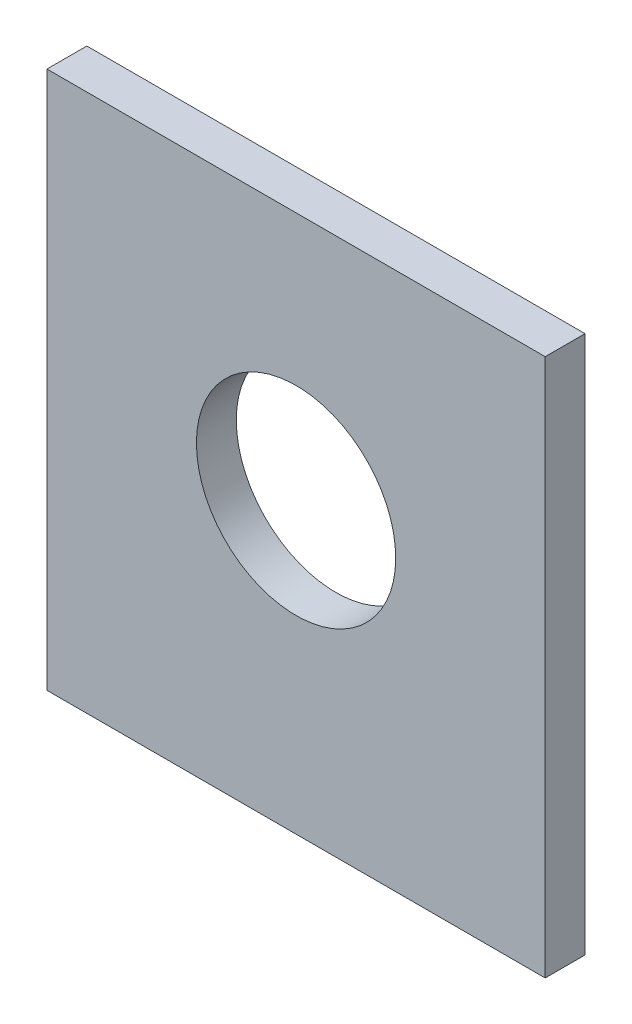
ISO-10303-21;
HEADER;
FILE_DESCRIPTION(('STEP AP214'),'2;1');
FILE_NAME('part.step','',(''),(''),'','','');
FILE_SCHEMA(('AUTOMOTIVE_DESIGN { 1 0 10303 214 1 1 1 1 }'));
ENDSEC;
DATA;
#1=APPLICATION_CONTEXT('core data for automotive mechanical design processes');
#2=APPLICATION_PROTOCOL_DEFINITION('international standard','automotive_design',2000,#1);
#3=PRODUCT_CONTEXT('',#1,'mechanical');
#4=PRODUCT('Part','Part','',(#3));
#5=PRODUCT_RELATED_PRODUCT_CATEGORY('part','',(#4));
#6=PRODUCT_DEFINITION_FORMATION('','',#4);
#7=PRODUCT_DEFINITION_CONTEXT('part definition',#1,'design');
#8=PRODUCT_DEFINITION('design','',#6,#7);
#9=PRODUCT_DEFINITION_SHAPE('','',#8);
#10=(LENGTH_UNIT() NAMED_UNIT(*) SI_UNIT(.MILLI.,.METRE.));
#11=(NAMED_UNIT(*) PLANE_ANGLE_UNIT() SI_UNIT($,.RADIAN.));
#12=(NAMED_UNIT(*) SI_UNIT($,.STERADIAN.) SOLID_ANGLE_UNIT());
#13=UNCERTAINTY_MEASURE_WITH_UNIT(LENGTH_MEASURE(1.E-05),#10,'distance_accuracy_value','');
#14=(GEOMETRIC_REPRESENTATION_CONTEXT(3) GLOBAL_UNCERTAINTY_ASSIGNED_CONTEXT((#13)) GLOBAL_UNIT_ASSIGNED_CONTEXT((#10,
#11,#12)) REPRESENTATION_CONTEXT('',''));
#15=CARTESIAN_POINT('',(0.,0.,0.));
#16=DIRECTION('',(0.,0.,1.));
#17=DIRECTION('',(1.,0.,0.));
#18=AXIS2_PLACEMENT_3D('',#15,#16,#17);
#19=CARTESIAN_POINT('',(12.5,13.5,1.));
#20=DIRECTION('',(-1.,0.,0.));
#21=DIRECTION('',(0.,-1.,0.));
#22=AXIS2_PLACEMENT_3D('',#19,#20,#21);
#23=PLANE('',#22);
#24=DIRECTION('',(0.,1.,0.));
#25=VECTOR('',#24,1.);
#26=CARTESIAN_POINT('',(12.5,13.5,-1.));
#27=LINE('',#26,#25);
#28=CARTESIAN_POINT('',(12.5,-13.5,-1.));
#29=VERTEX_POINT('',#28);
#30=CARTESIAN_POINT('',(12.5,13.5,-1.));
#31=VERTEX_POINT('',#30);
#32=EDGE_CURVE('E70',#29,#31,#27,.T.);
#33=ORIENTED_EDGE('',*,*,#32,.T.);
#34=DIRECTION('',(0.,0.,-1.));
#35=VECTOR('',#34,1.);
#36=CARTESIAN_POINT('',(12.5,13.5,1.));
#37=LINE('',#36,#35);
#38=CARTESIAN_POINT('',(12.5,13.5,1.));
#39=VERTEX_POINT('',#38);
#40=EDGE_CURVE('E11',#39,#31,#37,.T.);
#41=ORIENTED_EDGE('',*,*,#40,.F.);
#42=DIRECTION('',(0.,1.,0.));
#43=VECTOR('',#42,1.);
#44=CARTESIAN_POINT('',(12.5,13.5,1.));
#45=LINE('',#44,#43);
#46=CARTESIAN_POINT('',(12.5,-13.5,1.));
#47=VERTEX_POINT('',#46);
#48=EDGE_CURVE('E93',#47,#39,#45,.T.);
#49=ORIENTED_EDGE('',*,*,#48,.F.);
#50=DIRECTION('',(0.,0.,-1.));
#51=VECTOR('',#50,1.);
#52=CARTESIAN_POINT('',(12.5,-13.5,1.));
#53=LINE('',#52,#51);
#54=EDGE_CURVE('E82',#47,#29,#53,.T.);
#55=ORIENTED_EDGE('',*,*,#54,.T.);
#56=EDGE_LOOP('',(#33,#41,#49,#55));
#57=FACE_BOUND('',#56,.T.);
#58=ADVANCED_FACE('F26',(#57),#23,.F.);
#59=CARTESIAN_POINT('',(12.5,13.5,1.));
#60=DIRECTION('',(0.,-1.,0.));
#61=DIRECTION('',(1.,0.,0.));
#62=AXIS2_PLACEMENT_3D('',#59,#60,#61);
#63=PLANE('',#62);
#64=DIRECTION('',(-1.,0.,0.));
#65=VECTOR('',#64,1.);
#66=CARTESIAN_POINT('',(12.5,13.5,-1.));
#67=LINE('',#66,#65);
#68=CARTESIAN_POINT('',(-12.5,13.5,-1.));
#69=VERTEX_POINT('',#68);
#70=EDGE_CURVE('E66',#31,#69,#67,.T.);
#71=ORIENTED_EDGE('',*,*,#70,.T.);
#72=DIRECTION('',(0.,0.,-1.));
#73=VECTOR('',#72,1.);
#74=CARTESIAN_POINT('',(-12.5,13.5,1.));
#75=LINE('',#74,#73);
#76=CARTESIAN_POINT('',(-12.5,13.5,1.));
#77=VERTEX_POINT('',#76);
#78=EDGE_CURVE('E33',#77,#69,#75,.T.);
#79=ORIENTED_EDGE('',*,*,#78,.F.);
#80=DIRECTION('',(-1.,0.,0.));
#81=VECTOR('',#80,1.);
#82=CARTESIAN_POINT('',(12.5,13.5,1.));
#83=LINE('',#82,#81);
#84=EDGE_CURVE('E78',#39,#77,#83,.T.);
#85=ORIENTED_EDGE('',*,*,#84,.F.);
#86=ORIENTED_EDGE('',*,*,#40,.T.);
#87=EDGE_LOOP('',(#71,#79,#85,#86));
#88=FACE_BOUND('',#87,.T.);
#89=ADVANCED_FACE('F77',(#88),#63,.F.);
#90=CARTESIAN_POINT('',(-12.5,13.5,1.));
#91=DIRECTION('',(1.,0.,0.));
#92=DIRECTION('',(0.,1.,0.));
#93=AXIS2_PLACEMENT_3D('',#90,#91,#92);
#94=PLANE('',#93);
#95=DIRECTION('',(0.,-1.,0.));
#96=VECTOR('',#95,1.);
#97=CARTESIAN_POINT('',(-12.5,13.5,-1.));
#98=LINE('',#97,#96);
#99=CARTESIAN_POINT('',(-12.5,-13.5,-1.));
#100=VERTEX_POINT('',#99);
#101=EDGE_CURVE('E71',#69,#100,#98,.T.);
#102=ORIENTED_EDGE('',*,*,#101,.T.);
#103=DIRECTION('',(0.,0.,-1.));
#104=VECTOR('',#103,1.);
#105=CARTESIAN_POINT('',(-12.5,-13.5,1.));
#106=LINE('',#105,#104);
#107=CARTESIAN_POINT('',(-12.5,-13.5,1.));
#108=VERTEX_POINT('',#107);
#109=EDGE_CURVE('E99',#108,#100,#106,.T.);
#110=ORIENTED_EDGE('',*,*,#109,.F.);
#111=DIRECTION('',(0.,-1.,0.));
#112=VECTOR('',#111,1.);
#113=CARTESIAN_POINT('',(-12.5,13.5,1.));
#114=LINE('',#113,#112);
#115=EDGE_CURVE('E45',#77,#108,#114,.T.);
#116=ORIENTED_EDGE('',*,*,#115,.F.);
#117=ORIENTED_EDGE('',*,*,#78,.T.);
#118=EDGE_LOOP('',(#102,#110,#116,#117));
#119=FACE_BOUND('',#118,.T.);
#120=ADVANCED_FACE('F102',(#119),#94,.F.);
#121=CARTESIAN_POINT('',(12.5,-13.5,1.));
#122=DIRECTION('',(0.,1.,0.));
#123=DIRECTION('',(-1.,0.,0.));
#124=AXIS2_PLACEMENT_3D('',#121,#122,#123);
#125=PLANE('',#124);
#126=DIRECTION('',(1.,0.,0.));
#127=VECTOR('',#126,1.);
#128=CARTESIAN_POINT('',(12.5,-13.5,-1.));
#129=LINE('',#128,#127);
#130=EDGE_CURVE('E91',#100,#29,#129,.T.);
#131=ORIENTED_EDGE('',*,*,#130,.T.);
#132=ORIENTED_EDGE('',*,*,#54,.F.);
#133=DIRECTION('',(1.,0.,0.));
#134=VECTOR('',#133,1.);
#135=CARTESIAN_POINT('',(12.5,-13.5,1.));
#136=LINE('',#135,#134);
#137=EDGE_CURVE('E40',#108,#47,#136,.T.);
#138=ORIENTED_EDGE('',*,*,#137,.F.);
#139=ORIENTED_EDGE('',*,*,#109,.T.);
#140=EDGE_LOOP('',(#131,#132,#138,#139));
#141=FACE_BOUND('',#140,.T.);
#142=ADVANCED_FACE('F104',(#141),#125,.F.);
#143=CARTESIAN_POINT('',(12.5,13.5,1.));
#144=DIRECTION('',(0.,0.,-1.));
#145=DIRECTION('',(-1.,0.,0.));
#146=AXIS2_PLACEMENT_3D('',#143,#144,#145);
#147=PLANE('',#146);
#148=CARTESIAN_POINT('',(0.,0.999999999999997,1.));
#149=DIRECTION('',(0.,0.,1.));
#150=DIRECTION('',(1.,0.,0.));
#151=AXIS2_PLACEMENT_3D('',#148,#149,#150);
#152=CIRCLE('',#151,5.);
#153=CARTESIAN_POINT('',(5.,0.999999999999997,1.));
#154=VERTEX_POINT('',#153);
#155=EDGE_CURVE('E83',#154,#154,#152,.T.);
#156=ORIENTED_EDGE('',*,*,#155,.F.);
#157=EDGE_LOOP('',(#156));
#158=FACE_BOUND('',#157,.T.);
#159=ORIENTED_EDGE('',*,*,#48,.T.);
#160=ORIENTED_EDGE('',*,*,#84,.T.);
#161=ORIENTED_EDGE('',*,*,#115,.T.);
#162=ORIENTED_EDGE('',*,*,#137,.T.);
#163=EDGE_LOOP('',(#159,#160,#161,#162));
#164=FACE_BOUND('',#163,.T.);
#165=ADVANCED_FACE('F105',(#158,#164),#147,.F.);
#166=CARTESIAN_POINT('',(12.5,13.5,-1.));
#167=DIRECTION('',(0.,0.,-1.));
#168=DIRECTION('',(-1.,0.,0.));
#169=AXIS2_PLACEMENT_3D('',#166,#167,#168);
#170=PLANE('',#169);
#171=CARTESIAN_POINT('',(0.,0.999999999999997,-1.));
#172=DIRECTION('',(0.,0.,-1.));
#173=DIRECTION('',(-1.,0.,0.));
#174=AXIS2_PLACEMENT_3D('',#171,#172,#173);
#175=CIRCLE('',#174,5.);
#176=CARTESIAN_POINT('',(-5.,0.999999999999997,-1.));
#177=VERTEX_POINT('',#176);
#178=EDGE_CURVE('E86',#177,#177,#175,.F.);
#179=ORIENTED_EDGE('',*,*,#178,.T.);
#180=EDGE_LOOP('',(#179));
#181=FACE_BOUND('',#180,.T.);
#182=ORIENTED_EDGE('',*,*,#32,.F.);
#183=ORIENTED_EDGE('',*,*,#130,.F.);
#184=ORIENTED_EDGE('',*,*,#101,.F.);
#185=ORIENTED_EDGE('',*,*,#70,.F.);
#186=EDGE_LOOP('',(#182,#183,#184,#185));
#187=FACE_BOUND('',#186,.T.);
#188=ADVANCED_FACE('F67',(#181,#187),#170,.T.);
#189=CARTESIAN_POINT('',(0.,0.999999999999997,-1.001));
#190=DIRECTION('',(0.,0.,1.));
#191=DIRECTION('',(1.,0.,0.));
#192=AXIS2_PLACEMENT_3D('',#189,#190,#191);
#193=CYLINDRICAL_SURFACE('',#192,5.);
#194=ORIENTED_EDGE('',*,*,#178,.F.);
#195=EDGE_LOOP('',(#194));
#196=FACE_BOUND('',#195,.T.);
#197=ORIENTED_EDGE('',*,*,#155,.T.);
#198=EDGE_LOOP('',(#197));
#199=FACE_BOUND('',#198,.T.);
#200=ADVANCED_FACE('F113',(#196,#199),#193,.F.);
#201=CLOSED_SHELL('',(#58,#89,#120,#142,#165,#188,#200));
#202=MANIFOLD_SOLID_BREP('B2',#201);
#203=ADVANCED_BREP_SHAPE_REPRESENTATION('',(#18,#202),#14);
#204=SHAPE_DEFINITION_REPRESENTATION(#9,#203);
ENDSEC;
END-ISO-10303-21;
